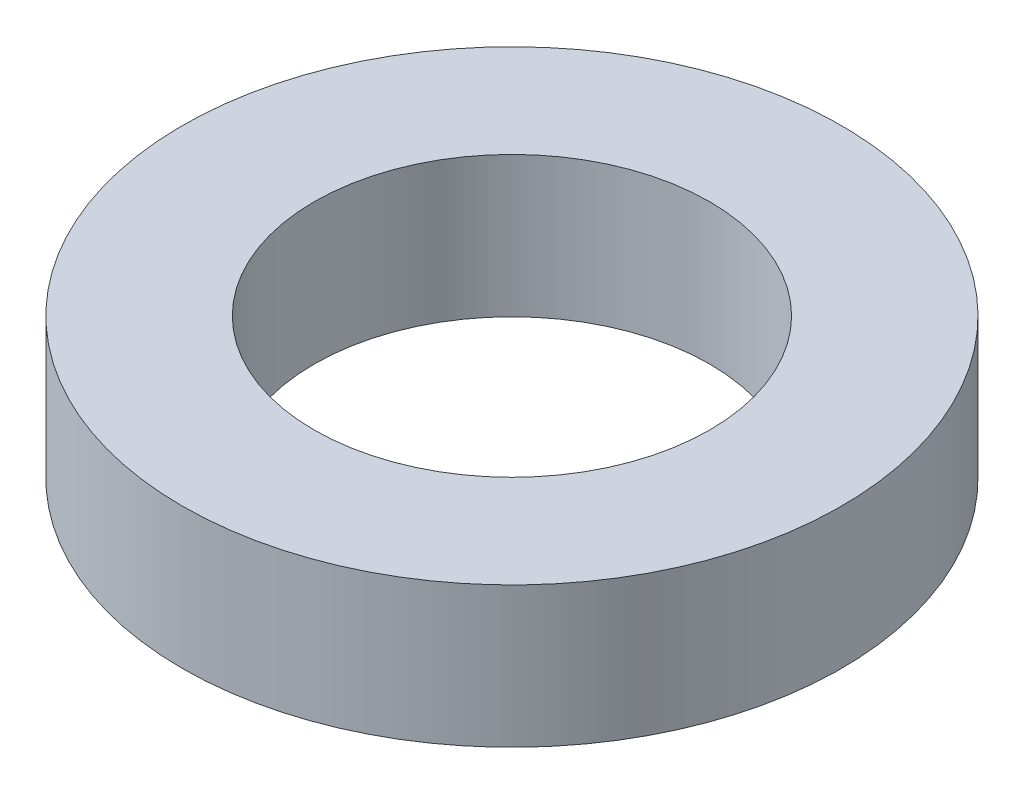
from build123d import *

# Parameters (mm, degrees)
SKETCH1_R           = 23.8125
SKETCH1_R_2         = 14.2875
BOSS_EXTRUDE1_DEPTH = 10.16


with BuildPart() as part:
    # Sketch1 → Boss-Extrude1 (new body)
    with BuildSketch(Plane(origin=(0, 0, 0), x_dir=(1, 0, 0), z_dir=(0, 1, 0))):
        with Locations(Location((0, 0, 0), (0, 0, 270))):
            Circle(SKETCH1_R)
        with Locations(Location((0, 0, 0), (0, 0, 270))):
            Circle(SKETCH1_R_2, mode=Mode.SUBTRACT)
    extrude(amount=-BOSS_EXTRUDE1_DEPTH)


solid = part.part
